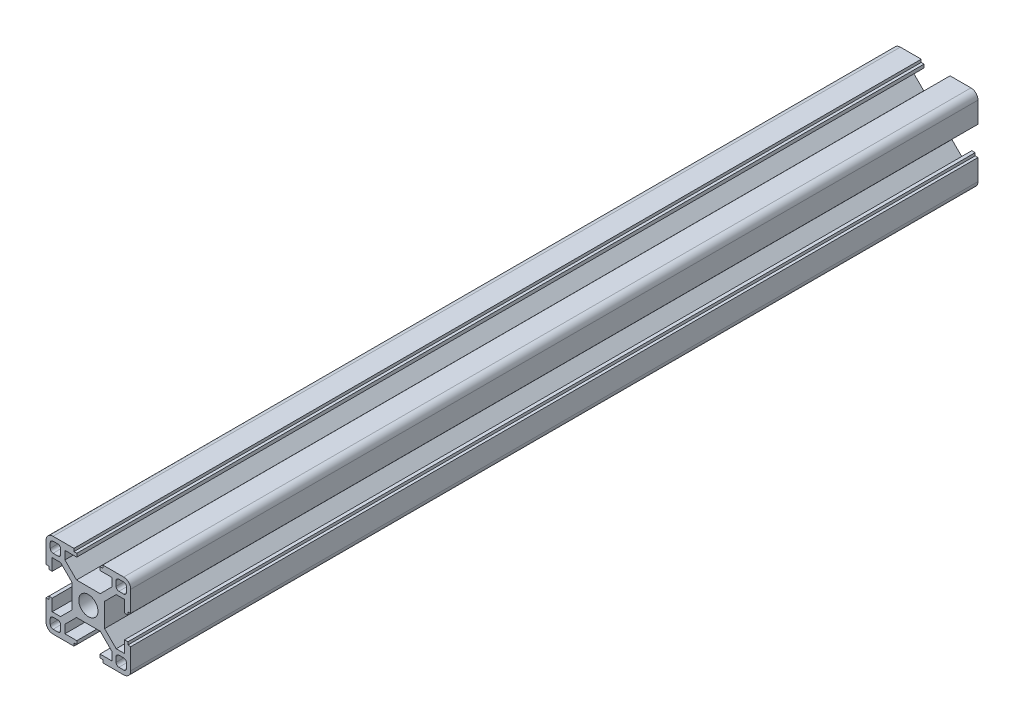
from build123d import *

# Parameters (mm, degrees)
EXTRUDE_1_DEPTH = 150


with BuildPart() as part:
    # Sketch 1 → Extrude 1 (new, symmetric)
    with BuildSketch(Plane.XY):
        with BuildLine():
            Line((-12.49999999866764, -14.999999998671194), (-5.1000000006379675, -14.999999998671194))
            Line((-5.1000000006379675, -14.999999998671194), (-5.1000000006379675, -13.99999999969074))
            Line((-5.1000000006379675, -13.99999999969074), (-4.099999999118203, -13.99999999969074))
            Line((-4.099999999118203, -13.99999999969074), (-4.099999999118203, -12.799999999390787))
            Line((-4.099999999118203, -12.799999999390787), (-8.29999999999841, -12.799999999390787))
            Line((-8.29999999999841, -12.799999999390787), (-8.29999999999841, -9.855634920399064))
            Line((-8.29999999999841, -9.855634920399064), (-4.194365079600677, -5.750000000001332))
            Line((-4.194365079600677, -5.750000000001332), (1.31666e-12, -5.750000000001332))
            Line((1.31666e-12, -5.750000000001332), (4.194365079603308, -5.750000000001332))
            Line((4.194365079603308, -5.750000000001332), (8.300000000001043, -9.855634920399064))
            Line((8.300000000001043, -9.855634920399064), (8.300000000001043, -12.799999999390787))
            Line((8.300000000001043, -12.799999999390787), (4.0999999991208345, -12.799999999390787))
            Line((4.0999999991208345, -12.799999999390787), (4.0999999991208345, -13.999999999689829))
            Line((4.0999999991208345, -13.999999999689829), (5.100000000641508, -13.999999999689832))
            Line((5.100000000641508, -13.999999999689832), (5.100000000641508, -14.999999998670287))
            Line((5.100000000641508, -14.999999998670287), (12.499999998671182, -14.999999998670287))
            ThreePointArc((12.499999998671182, -14.999999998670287), (14.267766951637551, -14.267766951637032), (14.99999999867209, -12.499999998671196))
            Line((14.99999999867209, -12.499999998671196), (14.99999999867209, -5.100000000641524))
            Line((14.99999999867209, -5.100000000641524), (13.999999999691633, -5.100000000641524))
            Line((13.999999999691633, -5.100000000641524), (13.999999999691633, -4.099999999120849))
            Line((13.999999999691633, -4.099999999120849), (12.79999999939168, -4.099999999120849))
            Line((12.79999999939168, -4.099999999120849), (12.79999999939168, -8.300000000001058))
            Line((12.79999999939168, -8.300000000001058), (9.855634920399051, -8.300000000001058))
            Line((9.855634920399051, -8.300000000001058), (5.750000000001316, -4.194365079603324))
            Line((5.750000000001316, -4.194365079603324), (5.750000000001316, -1.33053e-12))
            Line((5.750000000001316, -1.33053e-12), (5.750000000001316, 4.194365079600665))
            Line((5.750000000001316, 4.194365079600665), (9.855634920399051, 8.299999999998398))
            Line((9.855634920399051, 8.299999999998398), (12.79999999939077, 8.299999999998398))
            Line((12.79999999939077, 8.299999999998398), (12.79999999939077, 4.099999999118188))
            Line((12.79999999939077, 4.099999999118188), (13.999999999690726, 4.099999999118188))
            Line((13.999999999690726, 4.099999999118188), (13.999999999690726, 5.100000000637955))
            Line((13.999999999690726, 5.100000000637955), (14.99999999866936, 5.100000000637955))
            Line((14.99999999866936, 5.100000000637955), (14.999999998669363, 12.499999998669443))
            ThreePointArc((14.999999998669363, 12.499999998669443), (14.267766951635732, 14.267766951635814), (12.49999999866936, 14.99999999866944))
            Line((12.49999999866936, 14.99999999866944), (5.10000000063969, 14.99999999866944))
            Line((5.10000000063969, 14.99999999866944), (5.10000000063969, 13.999999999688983))
            Line((5.10000000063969, 13.999999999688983), (4.099999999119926, 13.999999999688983))
            Line((4.099999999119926, 13.999999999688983), (4.099999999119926, 12.799999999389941))
            Line((4.099999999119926, 12.799999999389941), (8.300000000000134, 12.799999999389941))
            Line((8.300000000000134, 12.799999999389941), (8.300000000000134, 9.855634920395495))
            Line((8.300000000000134, 9.855634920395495), (4.194365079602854, 5.749999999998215))
            Line((4.194365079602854, 5.749999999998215), (8.6042e-13, 5.749999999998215))
            Line((8.6042e-13, 5.749999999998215), (-4.194365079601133, 5.749999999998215))
            Line((-4.194365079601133, 5.749999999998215), (-8.299999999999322, 9.855634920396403))
            Line((-8.299999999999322, 9.855634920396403), (-8.299999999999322, 12.799999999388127))
            Line((-8.299999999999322, 12.799999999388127), (-4.099999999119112, 12.799999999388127))
            Line((-4.099999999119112, 12.799999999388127), (-4.099999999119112, 13.999999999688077))
            Line((-4.099999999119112, 13.999999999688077), (-5.100000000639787, 13.999999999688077))
            Line((-5.100000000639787, 13.999999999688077), (-5.100000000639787, 14.999999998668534))
            Line((-5.100000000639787, 14.999999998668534), (-12.499999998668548, 14.999999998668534))
            ThreePointArc((-12.499999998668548, 14.999999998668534), (-14.267766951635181, 14.267766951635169), (-14.99999999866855, 12.499999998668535))
            Line((-14.99999999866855, 12.499999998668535), (-14.999999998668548, 5.100000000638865))
            Line((-14.999999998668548, 5.100000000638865), (-13.999999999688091, 5.100000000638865))
            Line((-13.999999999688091, 5.100000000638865), (-13.999999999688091, 4.099999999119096))
            Line((-13.999999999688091, 4.099999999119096), (-12.79999999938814, 4.099999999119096))
            Line((-12.79999999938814, 4.099999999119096), (-12.79999999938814, 8.299999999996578))
            Line((-12.79999999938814, 8.299999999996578), (-9.855634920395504, 8.299999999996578))
            Line((-9.855634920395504, 8.299999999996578), (-5.749999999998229, 4.194365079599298))
            Line((-5.749999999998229, 4.194365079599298), (-5.749999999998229, -2.69576e-12))
            Line((-5.749999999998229, -2.69576e-12), (-5.749999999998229, -4.194365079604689))
            Line((-5.749999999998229, -4.194365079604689), (-9.855634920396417, -8.300000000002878))
            Line((-9.855634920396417, -8.300000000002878), (-12.799999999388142, -8.300000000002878))
            Line((-12.799999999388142, -8.300000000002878), (-12.799999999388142, -4.0999999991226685))
            Line((-12.799999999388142, -4.0999999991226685), (-13.999999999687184, -4.0999999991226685))
            Line((-13.999999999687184, -4.0999999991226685), (-13.999999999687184, -5.100000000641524))
            Line((-13.999999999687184, -5.100000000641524), (-14.999999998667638, -5.100000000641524))
            Line((-14.999999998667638, -5.100000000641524), (-14.999999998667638, -12.499999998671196))
            ThreePointArc((-14.999999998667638, -12.499999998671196), (-14.267766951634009, -14.267766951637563), (-12.49999999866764, -14.999999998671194))
        make_face()
        with BuildLine():
            Line((-9.799999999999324, 10.799999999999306), (-9.79999999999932, 12.499999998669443))
            ThreePointArc((-9.79999999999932, 12.499999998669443), (-10.092893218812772, 13.207106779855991), (-10.79999999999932, 13.499999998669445))
            Line((-10.79999999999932, 13.499999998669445), (-12.499999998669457, 13.499999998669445))
            ThreePointArc((-12.499999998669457, 13.499999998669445), (-13.207106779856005, 13.207106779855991), (-13.499999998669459, 12.499999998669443))
            Line((-13.499999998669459, 12.499999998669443), (-13.499999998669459, 10.799999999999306))
            ThreePointArc((-13.499999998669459, 10.799999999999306), (-13.207106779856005, 10.092893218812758), (-12.499999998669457, 9.799999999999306))
            Line((-12.499999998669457, 9.799999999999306), (-10.79999999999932, 9.799999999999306))
            ThreePointArc((-10.79999999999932, 9.799999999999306), (-10.092893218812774, 10.092893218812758), (-9.799999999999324, 10.799999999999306))
        make_face(mode=Mode.SUBTRACT)
        with BuildLine():
            Line((9.800000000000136, 12.499999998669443), (9.800000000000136, 10.800000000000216))
            ThreePointArc((9.800000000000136, 10.800000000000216), (10.092893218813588, 10.09289321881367), (10.800000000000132, 9.800000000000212))
            Line((10.800000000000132, 9.800000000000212), (12.499999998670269, 9.800000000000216))
            ThreePointArc((12.499999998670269, 9.800000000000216), (13.207106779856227, 10.09289321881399), (13.499999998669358, 10.800000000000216))
            Line((13.499999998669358, 10.800000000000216), (13.499999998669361, 12.499999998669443))
            ThreePointArc((13.499999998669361, 12.499999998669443), (13.20710677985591, 13.207106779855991), (12.49999999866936, 13.499999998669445))
            Line((12.49999999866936, 13.499999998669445), (10.800000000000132, 13.499999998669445))
            ThreePointArc((10.800000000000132, 13.499999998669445), (10.092893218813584, 13.207106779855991), (9.800000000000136, 12.499999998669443))
        make_face(mode=Mode.SUBTRACT)
        with BuildLine():
            Line((9.800000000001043, -10.800000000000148), (9.800000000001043, -12.499999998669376))
            ThreePointArc((9.800000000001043, -12.499999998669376), (10.092893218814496, -13.207106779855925), (10.800000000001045, -13.499999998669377))
            Line((10.800000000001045, -13.499999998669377), (12.499999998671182, -13.499999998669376))
            ThreePointArc((12.499999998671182, -13.499999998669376), (13.207106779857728, -13.207106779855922), (13.499999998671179, -12.499999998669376))
            Line((13.499999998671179, -12.499999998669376), (13.499999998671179, -10.800000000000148))
            ThreePointArc((13.499999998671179, -10.800000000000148), (13.207106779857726, -10.092893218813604), (12.499999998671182, -9.800000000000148))
            Line((12.499999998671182, -9.800000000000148), (10.800000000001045, -9.800000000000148))
            ThreePointArc((10.800000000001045, -9.800000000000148), (10.092893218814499, -10.0928932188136), (9.800000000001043, -10.800000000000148))
        make_face(mode=Mode.SUBTRACT)
        with BuildLine():
            Line((-9.79999999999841, -12.499999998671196), (-9.79999999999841, -10.80000000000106))
            ThreePointArc((-9.79999999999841, -10.80000000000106), (-10.092893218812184, -10.0928932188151), (-10.79999999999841, -9.800000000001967))
            Line((-10.79999999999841, -9.800000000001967), (-12.49999999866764, -9.800000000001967))
            ThreePointArc((-12.49999999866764, -9.800000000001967), (-13.207106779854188, -10.09289321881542), (-13.499999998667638, -10.800000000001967))
            Line((-13.499999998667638, -10.800000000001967), (-13.499999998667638, -12.499999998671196))
            ThreePointArc((-13.499999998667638, -12.499999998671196), (-13.207106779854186, -13.207106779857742), (-12.49999999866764, -13.499999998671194))
            Line((-12.49999999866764, -13.499999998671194), (-10.79999999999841, -13.499999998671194))
            ThreePointArc((-10.79999999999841, -13.499999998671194), (-10.092893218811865, -13.207106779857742), (-9.79999999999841, -12.499999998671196))
        make_face(mode=Mode.SUBTRACT)
        with BuildLine():
            ThreePointArc((8.6042e-13, 3.3999999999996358), (-2.404163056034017, 2.4041630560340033), (-3.3999999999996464, -8.7604e-13))
            ThreePointArc((-3.3999999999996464, -8.7604e-13), (-2.4041630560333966, -2.4041630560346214), (8.6042e-13, -3.3999999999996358))
            ThreePointArc((8.6042e-13, -3.3999999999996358), (2.4041630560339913, -2.404163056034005), (3.399999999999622, -8.7604e-13))
            ThreePointArc((3.399999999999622, -8.7604e-13), (2.4041630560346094, 2.404163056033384), (8.6042e-13, 3.3999999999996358))
        make_face(mode=Mode.SUBTRACT)
    extrude(amount=EXTRUDE_1_DEPTH, both=True)


solid = part.part
